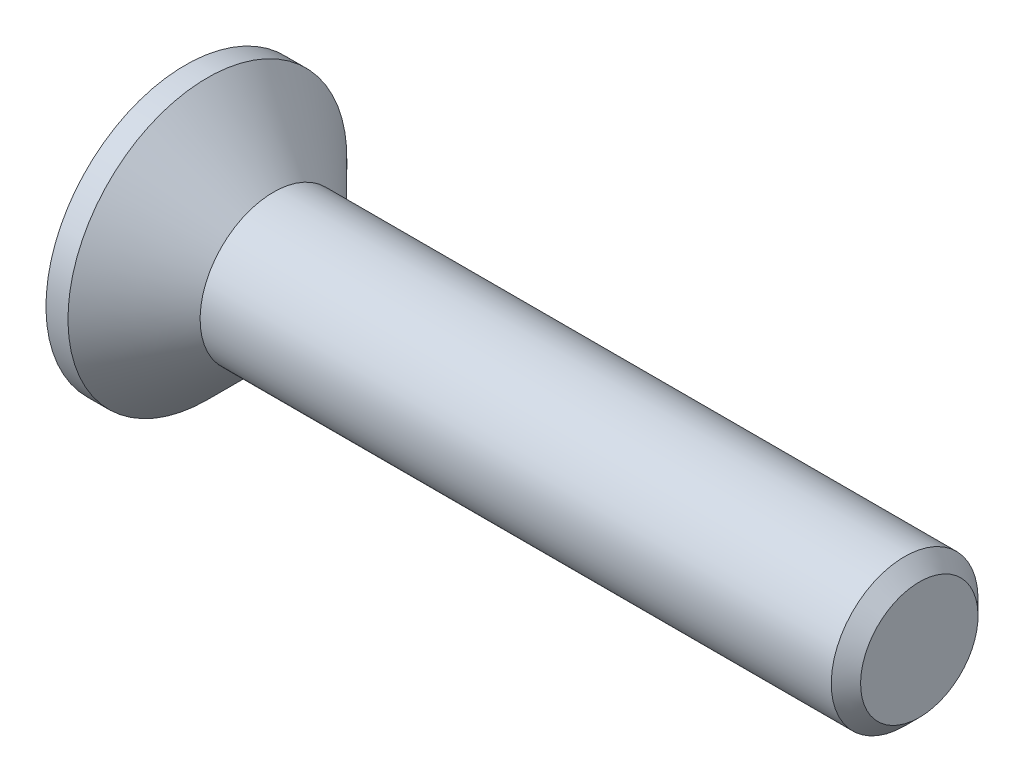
from build123d import *

# Parameters (mm, degrees)
CHAMFER1_SIZE      = 0.2
CUT_EXTRUDE1_DEPTH = 0.95


with BuildPart() as part:
    # Sketch1 → Revolve1 (revolve)
    with BuildSketch(Plane.XY, mode=Mode.PRIVATE) as revolve1_sk:
        Polygon((-1.2, 1.9), (-1.2, 0), (8.8, 0), (8.8, 1), (0, 1), (-0.9, 1.9), align=None)
    revolve(revolve1_sk.sketch.rotate(Axis((-1.2, 0, 0), (1, 0, 0)), 180), axis=Axis((-1.2, 0, 0), (1, 0, 0)))

    # Chamfer1
    chamfer1_edges = [part.edges().sort_by_distance(p)[0] for p in [
        (8.8, 1, 0),
    ]]
    chamfer(chamfer1_edges, length=CHAMFER1_SIZE)

    # Sketch2 → Cut-Extrude1 (cut)
    with BuildSketch(Plane.ZY.offset(1.2)):
        Polygon((-0.3, 1.175), (0.3, 1.175), (0.3, 0.3), (1.175, 0.3), (1.175, -0.3), (0.3, -0.3), (0.3, -1.175), (-0.3, -1.175), (-0.3, -0.3), (-1.175, -0.3), (-1.175, 0.3), (-0.3, 0.3), align=None)
    extrude(amount=-CUT_EXTRUDE1_DEPTH, mode=Mode.SUBTRACT)


solid = part.part
